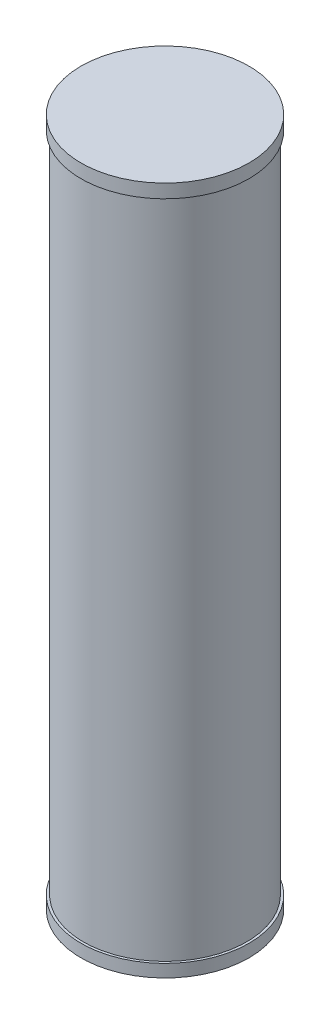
from build123d import *


with BuildPart() as part:
    # Sketch1 → Revolve1 (revolve)
    with BuildSketch(Plane.XY):
        Polygon((-109.5375, 880.11), (0, 880.11), (0, -17.78), (-109.5375, -17.78), (-109.5375, -1.27), (-106.4387, -1.27), (-106.4387, 862.33), (-109.5375, 862.33), align=None)
    revolve(axis=Axis((0, -15.994732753, 0), (0, -1, 0)))


solid = part.part
